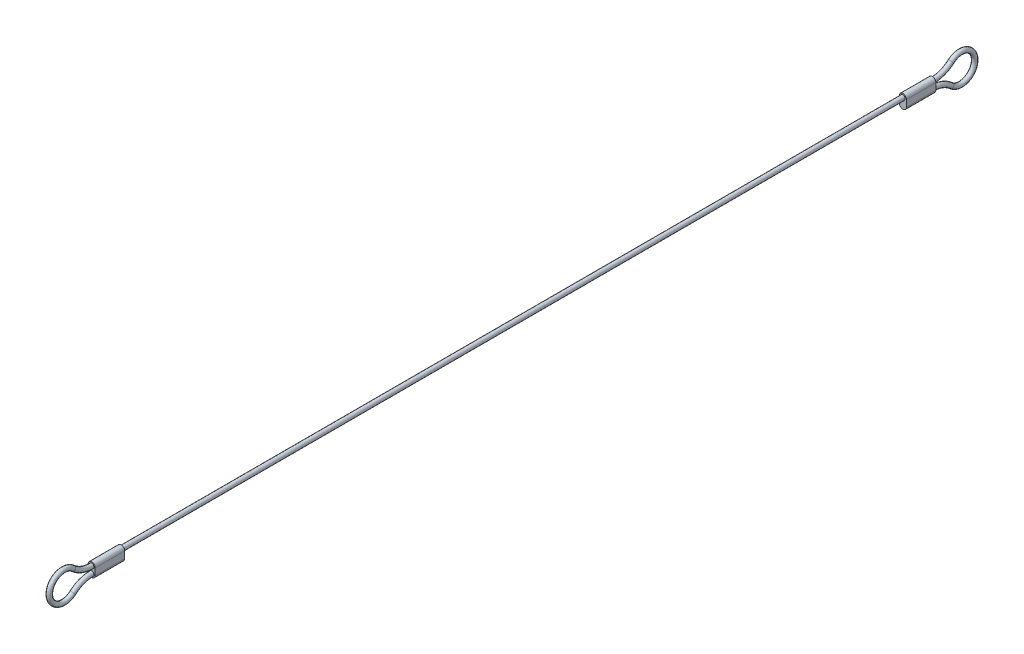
from build123d import *

# Parameters (mm, degrees)
SKETCH2_R           = 0.795
BOSS_EXTRUDE1_DEPTH = 10


with BuildPart() as part:
    # Sweep1: sweep along a path in Sketch1
    with BuildLine(Plane(origin=(0, 0, 0), x_dir=(0, 0, -1), z_dir=(1, 0, 0))) as sweep1_path:
        ThreePointArc((-142.8, -2.266252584), (-146.225492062, -2.898197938), (-149.2, -4.710835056))
        ThreePointArc((-149.2, -4.710835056), (-157.2, -1.133126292), (-149.2, 2.444582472))
        ThreePointArc((-149.2, 2.444582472), (-146.225492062, 0.631945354), (-142.8, 0))
        Line((-142.8, 0), (142.8, 0))
        ThreePointArc((142.8, 0), (146.225492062, 0.631945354), (149.2, 2.444582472))
        ThreePointArc((149.2, 2.444582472), (157.2, -1.133126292), (149.2, -4.710835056))
        ThreePointArc((149.2, -4.710835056), (146.225492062, -2.898197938), (142.8, -2.266252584))
    # Sketch2 → Sweep1 (sweep)
    with BuildSketch(Plane.XY):
        Circle(SKETCH2_R)
    sweep(path=sweep1_path.line)

    # Sketch3 → Boss-Extrude1 (add)
    with BuildSketch(Plane(origin=(0, 0, 142.8), x_dir=(-1, 0, 0), z_dir=(0, 0, -1))):
        with BuildLine():
            Line((1.2, 0), (1.2, -2.266252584))
            ThreePointArc((1.2, -2.266252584), (0, -3.466252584), (-1.2, -2.266252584))
            Line((-1.2, -2.266252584), (-1.2, 0))
            ThreePointArc((-1.2, 0), (0, 1.2), (1.2, 0))
        make_face()
    boss_extrude1 = extrude(amount=BOSS_EXTRUDE1_DEPTH)

    # Mirror1: Boss-Extrude1 across plane
    add(boss_extrude1.mirror(Plane.XY))


solid = part.part
